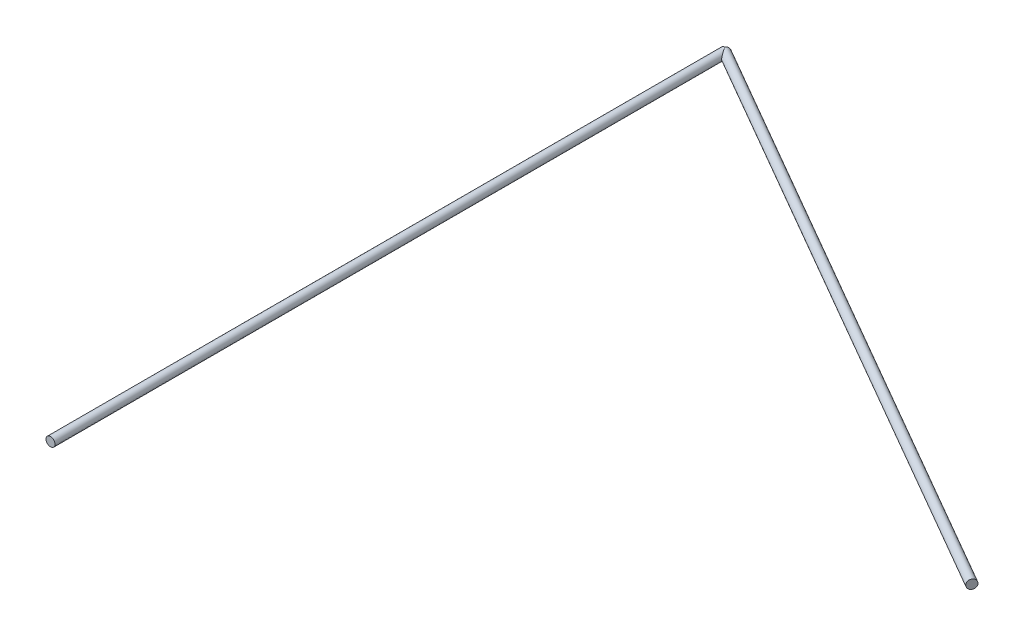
ISO-10303-21;
HEADER;
FILE_DESCRIPTION(('STEP AP214'),'2;1');
FILE_NAME('part.step','',(''),(''),'','','');
FILE_SCHEMA(('AUTOMOTIVE_DESIGN { 1 0 10303 214 1 1 1 1 }'));
ENDSEC;
DATA;
#1=APPLICATION_CONTEXT('core data for automotive mechanical design processes');
#2=APPLICATION_PROTOCOL_DEFINITION('international standard','automotive_design',2000,#1);
#3=PRODUCT_CONTEXT('',#1,'mechanical');
#4=PRODUCT('Part','Part','',(#3));
#5=PRODUCT_RELATED_PRODUCT_CATEGORY('part','',(#4));
#6=PRODUCT_DEFINITION_FORMATION('','',#4);
#7=PRODUCT_DEFINITION_CONTEXT('part definition',#1,'design');
#8=PRODUCT_DEFINITION('design','',#6,#7);
#9=PRODUCT_DEFINITION_SHAPE('','',#8);
#10=(LENGTH_UNIT() NAMED_UNIT(*) SI_UNIT(.MILLI.,.METRE.));
#11=(NAMED_UNIT(*) PLANE_ANGLE_UNIT() SI_UNIT($,.RADIAN.));
#12=(NAMED_UNIT(*) SI_UNIT($,.STERADIAN.) SOLID_ANGLE_UNIT());
#13=UNCERTAINTY_MEASURE_WITH_UNIT(LENGTH_MEASURE(1.E-05),#10,'distance_accuracy_value','');
#14=(GEOMETRIC_REPRESENTATION_CONTEXT(3) GLOBAL_UNCERTAINTY_ASSIGNED_CONTEXT((#13)) GLOBAL_UNIT_ASSIGNED_CONTEXT((#10,
#11,#12)) REPRESENTATION_CONTEXT('',''));
#15=CARTESIAN_POINT('',(0.,0.,0.));
#16=DIRECTION('',(0.,0.,1.));
#17=DIRECTION('',(1.,0.,0.));
#18=AXIS2_PLACEMENT_3D('',#15,#16,#17);
#19=CARTESIAN_POINT('',(0.,0.,300.));
#20=DIRECTION('',(0.,0.,-1.));
#21=DIRECTION('',(-1.,0.,0.));
#22=AXIS2_PLACEMENT_3D('',#19,#20,#21);
#23=CYLINDRICAL_SURFACE('',#22,2.);
#24=CARTESIAN_POINT('',(0.,0.,300.));
#25=DIRECTION('',(0.,0.,1.));
#26=DIRECTION('',(1.,0.,0.));
#27=AXIS2_PLACEMENT_3D('',#24,#25,#26);
#28=CIRCLE('',#27,2.);
#29=CARTESIAN_POINT('',(2.,0.,300.));
#30=VERTEX_POINT('',#29);
#31=EDGE_CURVE('E41',#30,#30,#28,.T.);
#32=ORIENTED_EDGE('',*,*,#31,.F.);
#33=EDGE_LOOP('',(#32));
#34=FACE_BOUND('',#33,.T.);
#35=CARTESIAN_POINT('',(0.,0.,0.));
#36=DIRECTION('',(0.866025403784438,0.,-0.500000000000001));
#37=DIRECTION('',(-0.500000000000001,0.,-0.866025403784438));
#38=AXIS2_PLACEMENT_3D('',#35,#36,#37);
#39=ELLIPSE('',#38,3.99999999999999,2.);
#40=CARTESIAN_POINT('',(0.,2.,0.));
#41=VERTEX_POINT('',#40);
#42=CARTESIAN_POINT('',(0.,-2.,0.));
#43=VERTEX_POINT('',#42);
#44=EDGE_CURVE('E52',#41,#43,#39,.T.);
#45=ORIENTED_EDGE('',*,*,#44,.F.);
#46=CARTESIAN_POINT('',(0.,0.,0.));
#47=DIRECTION('',(0.,0.,1.));
#48=DIRECTION('',(1.,0.,0.));
#49=AXIS2_PLACEMENT_3D('',#46,#47,#48);
#50=CIRCLE('',#49,2.);
#51=EDGE_CURVE('E47',#41,#43,#50,.T.);
#52=ORIENTED_EDGE('',*,*,#51,.T.);
#53=EDGE_LOOP('',(#45,#52));
#54=FACE_BOUND('',#53,.T.);
#55=ADVANCED_FACE('F34',(#34,#54),#23,.T.);
#56=CARTESIAN_POINT('',(0.,0.,0.));
#57=DIRECTION('',(0.,0.,1.));
#58=DIRECTION('',(1.,0.,0.));
#59=AXIS2_PLACEMENT_3D('',#56,#57,#58);
#60=PLANE('',#59);
#61=DIRECTION('',(0.,1.,0.));
#62=VECTOR('',#61,1.);
#63=CARTESIAN_POINT('',(0.,0.,0.));
#64=LINE('',#63,#62);
#65=EDGE_CURVE('E11',#43,#41,#64,.T.);
#66=ORIENTED_EDGE('',*,*,#65,.F.);
#67=ORIENTED_EDGE('',*,*,#51,.F.);
#68=EDGE_LOOP('',(#66,#67));
#69=FACE_BOUND('',#68,.T.);
#70=ADVANCED_FACE('F49',(#69),#60,.F.);
#71=CARTESIAN_POINT('',(0.,0.,300.));
#72=DIRECTION('',(0.,0.,1.));
#73=DIRECTION('',(1.,0.,0.));
#74=AXIS2_PLACEMENT_3D('',#71,#72,#73);
#75=PLANE('',#74);
#76=ORIENTED_EDGE('',*,*,#31,.T.);
#77=EDGE_LOOP('',(#76));
#78=FACE_BOUND('',#77,.T.);
#79=ADVANCED_FACE('F69',(#78),#75,.T.);
#80=CARTESIAN_POINT('',(259.807621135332,0.,150.));
#81=DIRECTION('',(-0.866025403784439,0.,-0.499999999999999));
#82=DIRECTION('',(-0.499999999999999,0.,0.866025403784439));
#83=AXIS2_PLACEMENT_3D('',#80,#81,#82);
#84=CYLINDRICAL_SURFACE('',#83,2.);
#85=CARTESIAN_POINT('',(259.807621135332,0.,150.));
#86=DIRECTION('',(0.866025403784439,0.,0.499999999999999));
#87=DIRECTION('',(0.499999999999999,0.,-0.866025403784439));
#88=AXIS2_PLACEMENT_3D('',#85,#86,#87);
#89=CIRCLE('',#88,2.);
#90=CARTESIAN_POINT('',(260.807621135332,0.,148.267949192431));
#91=VERTEX_POINT('',#90);
#92=EDGE_CURVE('E56',#91,#91,#89,.T.);
#93=ORIENTED_EDGE('',*,*,#92,.F.);
#94=EDGE_LOOP('',(#93));
#95=FACE_BOUND('',#94,.T.);
#96=CARTESIAN_POINT('',(0.,0.,0.));
#97=DIRECTION('',(0.866025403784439,0.,0.499999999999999));
#98=DIRECTION('',(0.499999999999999,0.,-0.866025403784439));
#99=AXIS2_PLACEMENT_3D('',#96,#97,#98);
#100=CIRCLE('',#99,2.);
#101=EDGE_CURVE('E60',#43,#41,#100,.T.);
#102=ORIENTED_EDGE('',*,*,#101,.T.);
#103=ORIENTED_EDGE('',*,*,#44,.T.);
#104=EDGE_LOOP('',(#102,#103));
#105=FACE_BOUND('',#104,.T.);
#106=ADVANCED_FACE('F61',(#95,#105),#84,.T.);
#107=CARTESIAN_POINT('',(0.,0.,0.));
#108=DIRECTION('',(0.866025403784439,0.,0.499999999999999));
#109=DIRECTION('',(0.499999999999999,0.,-0.866025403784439));
#110=AXIS2_PLACEMENT_3D('',#107,#108,#109);
#111=PLANE('',#110);
#112=ORIENTED_EDGE('',*,*,#101,.F.);
#113=ORIENTED_EDGE('',*,*,#65,.T.);
#114=EDGE_LOOP('',(#112,#113));
#115=FACE_BOUND('',#114,.T.);
#116=ADVANCED_FACE('F59',(#115),#111,.F.);
#117=CARTESIAN_POINT('',(259.807621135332,0.,150.));
#118=DIRECTION('',(0.866025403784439,0.,0.499999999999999));
#119=DIRECTION('',(0.499999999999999,0.,-0.866025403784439));
#120=AXIS2_PLACEMENT_3D('',#117,#118,#119);
#121=PLANE('',#120);
#122=ORIENTED_EDGE('',*,*,#92,.T.);
#123=EDGE_LOOP('',(#122));
#124=FACE_BOUND('',#123,.T.);
#125=ADVANCED_FACE('F85',(#124),#121,.T.);
#126=CLOSED_SHELL('',(#55,#70,#79,#106,#116,#125));
#127=MANIFOLD_SOLID_BREP('B2',#126);
#128=ADVANCED_BREP_SHAPE_REPRESENTATION('',(#18,#127),#14);
#129=SHAPE_DEFINITION_REPRESENTATION(#9,#128);
ENDSEC;
END-ISO-10303-21;
